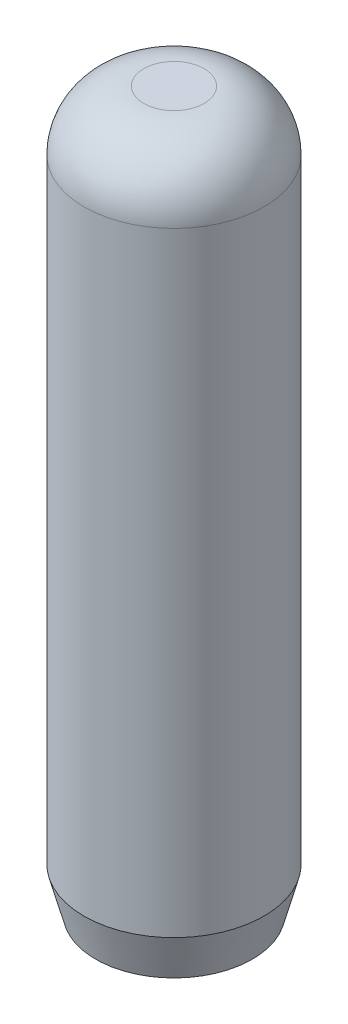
from build123d import *


with BuildPart() as part:
    # Sketch1 → Base-Revolve (revolve)
    with BuildSketch(Plane.XY, mode=Mode.PRIVATE) as base_revolve_sk:
        with BuildLine():
            Line((0, 0), (0, 9.525))
            Line((0, 9.525), (0.400685, 9.525))
            ThreePointArc((0.400685, 9.525), (0.961951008, 9.292516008), (1.194435, 8.73125))
            Line((1.194435, 8.73125), (1.194435, 0.572109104))
            Line((1.194435, 0.572109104), (1.041138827, 0))
            Line((1.041138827, 0), (0, 0))
        make_face()
    revolve(base_revolve_sk.sketch.rotate(Axis((0, 0, 0), (0, 1, 0)), 90), axis=Axis((0, 0, 0), (0, 1, 0)))


solid = part.part
